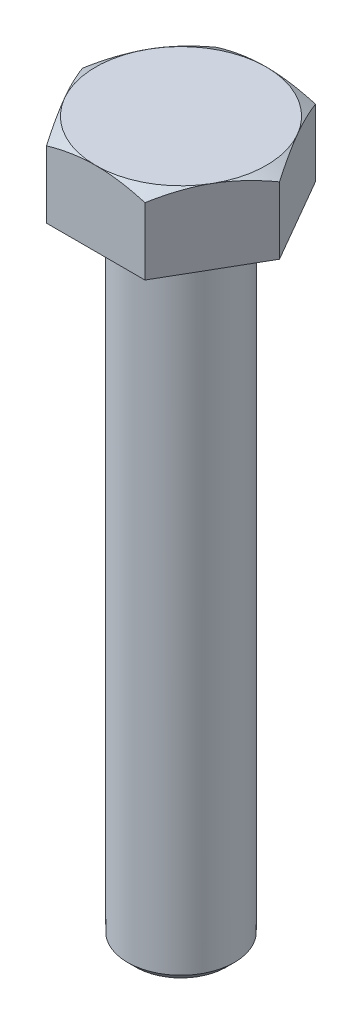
from build123d import *

# Parameters (mm, degrees)
BOSS_EXTRUDE1_DEPTH = 7
SKETCH3_R           = 5
BOSS_EXTRUDE2_DEPTH = 60
SKETCH2_OUTSIDE_W   = 58.988
SKETCH2_OUTSIDE_H   = 56.512
SKETCH2_OUTSIDE_R   = 8
CUT_EXTRUDE1_DEPTH  = 7
CUT_EXTRUDE1_DRAFT  = -60
SKETCH4_OUTSIDE_W   = 54.74
SKETCH4_OUTSIDE_H   = 52.264
SKETCH4_OUTSIDE_R   = 4.25
CUT_EXTRUDE2_DEPTH  = 10
CUT_EXTRUDE2_DRAFT  = -45


with BuildPart() as part:
    # Sketch1 → Boss-Extrude1 (new body)
    with BuildSketch(Plane(origin=(0, 0, 0), x_dir=(1, 0, 0), z_dir=(0, 1, 0))):
        Polygon((9.237604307, 0), (4.618802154, 8), (-4.618802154, 8), (-9.237604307, 0), (-4.618802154, -8), (4.618802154, -8), align=None)
    extrude(amount=BOSS_EXTRUDE1_DEPTH)

    # Sketch3 → Boss-Extrude2 (add)
    with BuildSketch(Plane.XZ):
        with Locations(Location((0, 0, 0), (0, 0, 90))):
            Circle(SKETCH3_R)
    extrude(amount=BOSS_EXTRUDE2_DEPTH)


with BuildPart() as cut_extrude1_tool:
    # Sketch2 outside → Cut-Extrude1 (with draft: the straight prism first)
    with BuildSketch(Plane(origin=(0, 7, 0), x_dir=(1, 0, 0), z_dir=(0, 1, 0))):
        Rectangle(SKETCH2_OUTSIDE_W, SKETCH2_OUTSIDE_H)
        Circle(SKETCH2_OUTSIDE_R, mode=Mode.SUBTRACT)
    extrude(amount=-CUT_EXTRUDE1_DEPTH)
    # Cut-Extrude1: the draft: its side faces are tilted about the plane it starts from
    cut_extrude1_sides = [cut_extrude1_tool.faces().sort_by_distance(p)[0] for p in [
        (0, 3.5, 28.256),
        (29.494, 3.5, 0),
        (0, 3.5, -28.256),
        (-29.494, 3.5, 0),
        (-8, 3.5, 0),
    ]]
    draft(cut_extrude1_sides, Plane(origin=(0, 7, 0), x_dir=(1, 0, 0), z_dir=(0, 1, 0)), CUT_EXTRUDE1_DRAFT)


with BuildPart() as part_1:
    add(part.part)

    # Cut-Extrude1: cut by cut_extrude1_tool
    add(cut_extrude1_tool.part, mode=Mode.SUBTRACT)


with BuildPart() as cut_extrude2_tool:
    # Sketch4 outside → Cut-Extrude2 (with draft: the straight prism first)
    with BuildSketch(Plane.XZ.offset(60)):
        Rectangle(SKETCH4_OUTSIDE_W, SKETCH4_OUTSIDE_H)
        Circle(SKETCH4_OUTSIDE_R, mode=Mode.SUBTRACT)
    extrude(amount=-CUT_EXTRUDE2_DEPTH)
    # Cut-Extrude2: the draft: its side faces are tilted about the plane it starts from
    cut_extrude2_sides = [cut_extrude2_tool.faces().sort_by_distance(p)[0] for p in [
        (0, -55, -26.132),
        (27.37, -55, 0),
        (0, -55, 26.132),
        (-27.37, -55, 0),
        (-4.25, -55, 0),
    ]]
    draft(cut_extrude2_sides, Plane.XZ.offset(60), CUT_EXTRUDE2_DRAFT)


with BuildPart() as part_2:
    add(part_1.part)

    # Cut-Extrude2: cut by cut_extrude2_tool
    add(cut_extrude2_tool.part, mode=Mode.SUBTRACT)


solid = part_2.part
